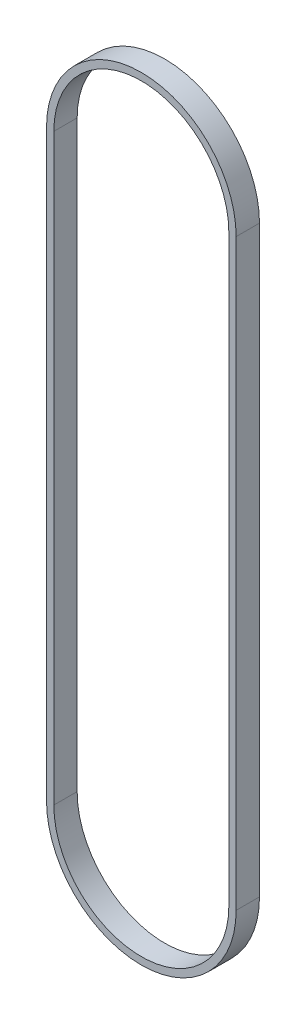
from build123d import *

# Parameters (mm, degrees)
EXTRUSION1_DEPTH = 16


with BuildPart() as part:
    # Esquisse1 → Extrusion1 (new body)
    with BuildSketch(Plane.XY):
        with BuildLine():
            Line((65, 0), (65, -400))
            ThreePointArc((65, -400), (0, -465), (-65, -400))
            Line((-65, -400), (-65, 0))
            ThreePointArc((-65, 0), (0, 65), (65, 0))
        make_face()
        with BuildLine():
            Line((60, 0), (60, -400))
            ThreePointArc((60, -400), (0, -460), (-60, -400))
            Line((-60, -400), (-60, 0))
            ThreePointArc((-60, 0), (0, 60), (60, 0))
        make_face(mode=Mode.SUBTRACT)
    extrude(amount=EXTRUSION1_DEPTH)


solid = part.part
